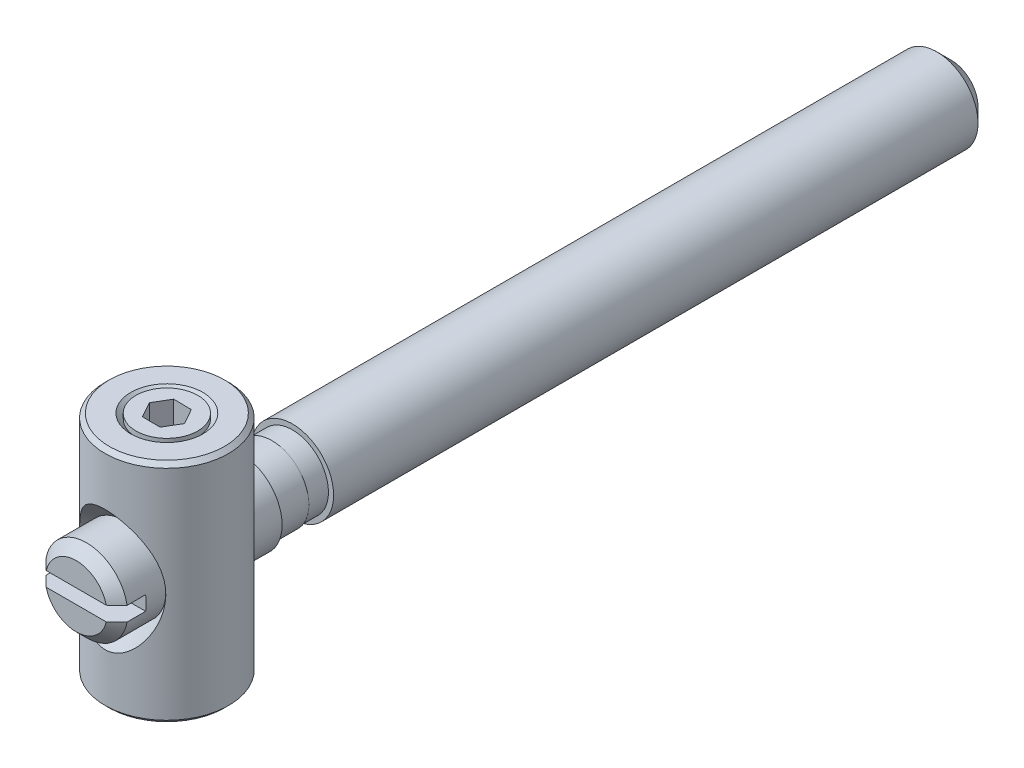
ISO-10303-21;
HEADER;
FILE_DESCRIPTION(('STEP AP214'),'2;1');
FILE_NAME('part.step','',(''),(''),'','','');
FILE_SCHEMA(('AUTOMOTIVE_DESIGN { 1 0 10303 214 1 1 1 1 }'));
ENDSEC;
DATA;
#1=APPLICATION_CONTEXT('core data for automotive mechanical design processes');
#2=APPLICATION_PROTOCOL_DEFINITION('international standard','automotive_design',2000,#1);
#3=PRODUCT_CONTEXT('',#1,'mechanical');
#4=PRODUCT('Part','Part','',(#3));
#5=PRODUCT_RELATED_PRODUCT_CATEGORY('part','',(#4));
#6=PRODUCT_DEFINITION_FORMATION('','',#4);
#7=PRODUCT_DEFINITION_CONTEXT('part definition',#1,'design');
#8=PRODUCT_DEFINITION('design','',#6,#7);
#9=PRODUCT_DEFINITION_SHAPE('','',#8);
#10=(LENGTH_UNIT() NAMED_UNIT(*) SI_UNIT(.MILLI.,.METRE.));
#11=(NAMED_UNIT(*) PLANE_ANGLE_UNIT() SI_UNIT($,.RADIAN.));
#12=(NAMED_UNIT(*) SI_UNIT($,.STERADIAN.) SOLID_ANGLE_UNIT());
#13=UNCERTAINTY_MEASURE_WITH_UNIT(LENGTH_MEASURE(1.E-05),#10,'distance_accuracy_value','');
#14=(GEOMETRIC_REPRESENTATION_CONTEXT(3) GLOBAL_UNCERTAINTY_ASSIGNED_CONTEXT((#13)) GLOBAL_UNIT_ASSIGNED_CONTEXT((#10,
#11,#12)) REPRESENTATION_CONTEXT('',''));
#15=CARTESIAN_POINT('',(0.,0.,0.));
#16=DIRECTION('',(0.,0.,1.));
#17=DIRECTION('',(1.,0.,0.));
#18=AXIS2_PLACEMENT_3D('',#15,#16,#17);
#19=CARTESIAN_POINT('',(0.,0.,34.697365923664));
#20=DIRECTION('',(0.,0.,1.));
#21=DIRECTION('',(1.,0.,0.));
#22=AXIS2_PLACEMENT_3D('',#19,#20,#21);
#23=CYLINDRICAL_SURFACE('',#22,2.);
#24=CARTESIAN_POINT('',(0.,0.,-37.398));
#25=DIRECTION('',(0.,0.,-1.));
#26=DIRECTION('',(0.,-1.,0.));
#27=AXIS2_PLACEMENT_3D('',#24,#25,#26);
#28=CIRCLE('',#27,2.);
#29=CARTESIAN_POINT('',(0.,-2.00000000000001,-37.398));
#30=VERTEX_POINT('',#29);
#31=EDGE_CURVE('E9',#30,#30,#28,.F.);
#32=ORIENTED_EDGE('',*,*,#31,.T.);
#33=EDGE_LOOP('',(#32));
#34=FACE_BOUND('',#33,.T.);
#35=CARTESIAN_POINT('',(0.,0.,-6.098));
#36=DIRECTION('',(0.,0.,1.));
#37=DIRECTION('',(1.,0.,0.));
#38=AXIS2_PLACEMENT_3D('',#35,#36,#37);
#39=CIRCLE('',#38,2.);
#40=CARTESIAN_POINT('',(2.,0.,-6.098));
#41=VERTEX_POINT('',#40);
#42=EDGE_CURVE('E283',#41,#41,#39,.T.);
#43=ORIENTED_EDGE('',*,*,#42,.F.);
#44=EDGE_LOOP('',(#43));
#45=FACE_BOUND('',#44,.T.);
#46=ADVANCED_FACE('F14',(#34,#45),#23,.T.);
#47=CARTESIAN_POINT('',(0.,0.,4.402));
#48=DIRECTION('',(0.,0.,-1.));
#49=DIRECTION('',(-1.,0.,0.));
#50=AXIS2_PLACEMENT_3D('',#47,#48,#49);
#51=PLANE('',#50);
#52=CARTESIAN_POINT('',(0.,0.,4.402));
#53=DIRECTION('',(0.,0.,-1.));
#54=DIRECTION('',(-1.,0.,0.));
#55=AXIS2_PLACEMENT_3D('',#52,#53,#54);
#56=CIRCLE('',#55,1.5);
#57=CARTESIAN_POINT('',(1.45859521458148,0.35,4.402));
#58=VERTEX_POINT('',#57);
#59=CARTESIAN_POINT('',(-1.45859521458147,0.35,4.402));
#60=VERTEX_POINT('',#59);
#61=EDGE_CURVE('E286',#58,#60,#56,.F.);
#62=ORIENTED_EDGE('',*,*,#61,.T.);
#63=DIRECTION('',(-1.,0.,0.));
#64=VECTOR('',#63,1.);
#65=CARTESIAN_POINT('',(-1.96913686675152,0.35,4.402));
#66=LINE('',#65,#64);
#67=EDGE_CURVE('E31',#58,#60,#66,.T.);
#68=ORIENTED_EDGE('',*,*,#67,.F.);
#69=EDGE_LOOP('',(#62,#68));
#70=FACE_BOUND('',#69,.T.);
#71=ADVANCED_FACE('F205',(#70),#51,.F.);
#72=CARTESIAN_POINT('',(-1.45859521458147,-0.35,4.402));
#73=VERTEX_POINT('',#72);
#74=CARTESIAN_POINT('',(1.45859521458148,-0.35,4.402));
#75=VERTEX_POINT('',#74);
#76=EDGE_CURVE('E292',#73,#75,#56,.F.);
#77=ORIENTED_EDGE('',*,*,#76,.T.);
#78=DIRECTION('',(1.,0.,0.));
#79=VECTOR('',#78,1.);
#80=CARTESIAN_POINT('',(-1.96913686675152,-0.35,4.402));
#81=LINE('',#80,#79);
#82=EDGE_CURVE('E324',#73,#75,#81,.T.);
#83=ORIENTED_EDGE('',*,*,#82,.F.);
#84=EDGE_LOOP('',(#77,#83));
#85=FACE_BOUND('',#84,.T.);
#86=ADVANCED_FACE('F212',(#85),#51,.F.);
#87=CARTESIAN_POINT('',(0.,0.,4.402));
#88=DIRECTION('',(0.,0.,-1.));
#89=DIRECTION('',(-1.,0.,0.));
#90=AXIS2_PLACEMENT_3D('',#87,#88,#89);
#91=CONICAL_SURFACE('',#90,1.5,0.785398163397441);
#92=CARTESIAN_POINT('',(4.35126885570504,0.349999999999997,1.53667748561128));
#93=CARTESIAN_POINT('',(4.19641291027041,0.35,1.69103028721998));
#94=CARTESIAN_POINT('',(4.04153476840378,0.350000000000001,1.84536085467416));
#95=CARTESIAN_POINT('',(3.73169612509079,0.350000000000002,2.15395346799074));
#96=CARTESIAN_POINT('',(3.57673562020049,0.350000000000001,2.30821551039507));
#97=CARTESIAN_POINT('',(3.2665365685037,0.350000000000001,2.616803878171));
#98=CARTESIAN_POINT('',(3.11129790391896,0.350000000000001,2.77113008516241));
#99=CARTESIAN_POINT('',(2.8006638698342,0.350000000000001,3.07961097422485));
#100=CARTESIAN_POINT('',(2.64526850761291,0.350000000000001,3.23376566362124));
#101=CARTESIAN_POINT('',(2.34228144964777,0.350000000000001,3.5338017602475));
#102=CARTESIAN_POINT('',(2.19470355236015,0.350000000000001,3.67969710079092));
#103=CARTESIAN_POINT('',(1.89910586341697,0.350000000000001,3.97107818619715));
#104=CARTESIAN_POINT('',(1.7510860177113,0.350000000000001,4.11656387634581));
#105=CARTESIAN_POINT('',(1.52844687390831,0.350000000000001,4.33406929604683));
#106=CARTESIAN_POINT('',(1.45415744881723,0.350000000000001,4.40642627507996));
#107=CARTESIAN_POINT('',(1.30522725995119,0.350000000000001,4.55078536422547));
#108=CARTESIAN_POINT('',(1.23058647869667,0.350000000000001,4.62278745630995));
#109=CARTESIAN_POINT('',(1.08076094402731,0.350000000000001,4.76619144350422));
#110=CARTESIAN_POINT('',(1.00557632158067,0.350000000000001,4.83759347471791));
#111=CARTESIAN_POINT('',(0.892022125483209,0.350000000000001,4.94386077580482));
#112=CARTESIAN_POINT('',(0.85404275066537,0.350000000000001,4.97914249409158));
#113=CARTESIAN_POINT('',(0.777709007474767,0.350000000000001,5.04929736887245));
#114=CARTESIAN_POINT('',(0.73935465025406,0.35,5.08417053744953));
#115=CARTESIAN_POINT('',(0.679196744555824,0.35,5.13798633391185));
#116=CARTESIAN_POINT('',(0.657585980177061,0.350000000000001,5.15714426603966));
#117=CARTESIAN_POINT('',(0.614138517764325,0.350000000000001,5.19520729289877));
#118=CARTESIAN_POINT('',(0.592301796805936,0.350000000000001,5.21411236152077));
#119=CARTESIAN_POINT('',(0.548146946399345,0.350000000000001,5.25174589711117));
#120=CARTESIAN_POINT('',(0.525826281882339,0.350000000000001,5.27047139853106));
#121=CARTESIAN_POINT('',(0.480797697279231,0.350000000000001,5.3074405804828));
#122=CARTESIAN_POINT('',(0.458089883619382,0.35,5.3256843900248));
#123=CARTESIAN_POINT('',(0.411906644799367,0.35,5.36167156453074));
#124=CARTESIAN_POINT('',(0.388425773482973,0.350000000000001,5.37940798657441));
#125=CARTESIAN_POINT('',(0.340709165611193,0.350000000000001,5.41383103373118));
#126=CARTESIAN_POINT('',(0.316473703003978,0.350000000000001,5.43051803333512));
#127=CARTESIAN_POINT('',(0.267118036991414,0.350000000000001,5.46212071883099));
#128=CARTESIAN_POINT('',(0.242006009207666,0.350000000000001,5.47704896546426));
#129=CARTESIAN_POINT('',(0.190376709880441,0.350000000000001,5.50417839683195));
#130=CARTESIAN_POINT('',(0.16386395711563,0.35,5.51638775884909));
#131=CARTESIAN_POINT('',(0.115662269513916,0.35,5.53389096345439));
#132=CARTESIAN_POINT('',(0.0943343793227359,0.350000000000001,5.54014013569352));
#133=CARTESIAN_POINT('',(0.050967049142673,0.350000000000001,5.54893856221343));
#134=CARTESIAN_POINT('',(0.0289307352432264,0.35,5.55150226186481));
#135=CARTESIAN_POINT('',(-0.0153473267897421,0.35,5.55236596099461));
#136=CARTESIAN_POINT('',(-0.0375895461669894,0.350000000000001,5.55064352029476));
#137=CARTESIAN_POINT('',(-0.0814521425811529,0.350000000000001,5.54330655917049));
#138=CARTESIAN_POINT('',(-0.10307022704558,0.35,5.53767922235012));
#139=CARTESIAN_POINT('',(-0.146000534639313,0.35,5.52332975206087));
#140=CARTESIAN_POINT('',(-0.167279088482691,0.350000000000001,5.51451156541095));
#141=CARTESIAN_POINT('',(-0.208879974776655,0.350000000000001,5.49482143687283));
#142=CARTESIAN_POINT('',(-0.229200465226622,0.350000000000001,5.48394572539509));
#143=CARTESIAN_POINT('',(-0.269207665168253,0.350000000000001,5.46074603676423));
#144=CARTESIAN_POINT('',(-0.288887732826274,0.350000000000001,5.44841081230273));
#145=CARTESIAN_POINT('',(-0.327605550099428,0.350000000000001,5.42281699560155));
#146=CARTESIAN_POINT('',(-0.346643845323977,0.35,5.40955921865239));
#147=CARTESIAN_POINT('',(-0.40644569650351,0.35,5.36638652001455));
#148=CARTESIAN_POINT('',(-0.446338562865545,0.35,5.33527476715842));
#149=CARTESIAN_POINT('',(-0.524892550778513,0.350000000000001,5.27152437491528));
#150=CARTESIAN_POINT('',(-0.563552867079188,0.350000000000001,5.23888477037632));
#151=CARTESIAN_POINT('',(-0.640169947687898,0.35,5.17265387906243));
#152=CARTESIAN_POINT('',(-0.678125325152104,0.350000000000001,5.1390609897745));
#153=CARTESIAN_POINT('',(-0.753518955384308,0.350000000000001,5.07132508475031));
#154=CARTESIAN_POINT('',(-0.790957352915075,0.350000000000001,5.03718222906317));
#155=CARTESIAN_POINT('',(-0.902510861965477,0.35,4.93443874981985));
#156=CARTESIAN_POINT('',(-0.976123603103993,0.350000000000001,4.86529362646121));
#157=CARTESIAN_POINT('',(-1.12257494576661,0.35,4.72634664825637));
#158=CARTESIAN_POINT('',(-1.19541427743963,0.35,4.65654555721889));
#159=CARTESIAN_POINT('',(-1.39829359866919,0.35,4.46099580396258));
#160=CARTESIAN_POINT('',(-1.52788326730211,0.35,4.33478022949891));
#161=CARTESIAN_POINT('',(-1.78647544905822,0.35,4.08174671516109));
#162=CARTESIAN_POINT('',(-1.91547795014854,0.35,3.95492876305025));
#163=CARTESIAN_POINT('',(-2.17321511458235,0.35,3.70088959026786));
#164=CARTESIAN_POINT('',(-2.30194960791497,0.35,3.57366819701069));
#165=CARTESIAN_POINT('',(-2.55921717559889,0.35,3.31902418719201));
#166=CARTESIAN_POINT('',(-2.68775025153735,0.35,3.19160157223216));
#167=CARTESIAN_POINT('',(-3.07247665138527,0.35,2.80981746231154));
#168=CARTESIAN_POINT('',(-3.32848011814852,0.349999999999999,2.55526465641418));
#169=CARTESIAN_POINT('',(-3.71223239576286,0.35,2.17332351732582));
#170=CARTESIAN_POINT('',(-3.84007220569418,0.35,2.04602651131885));
#171=CARTESIAN_POINT('',(-4.09570351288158,0.349999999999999,1.79138474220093));
#172=CARTESIAN_POINT('',(-4.22349501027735,0.349999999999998,1.66403997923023));
#173=CARTESIAN_POINT('',(-4.35126885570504,0.349999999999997,1.53667748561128));
#174=B_SPLINE_CURVE_WITH_KNOTS('',3,(#92,#93,#94,#95,#96,#97,#98,#99,#100,#101,#102,#103,#104,
#105,#106,#107,#108,#109,#110,#111,#112,#113,#114,#115,#116,#117,#118,#119,#120,#121,#122,#123,
#124,#125,#126,#127,#128,#129,#130,#131,#132,#133,#134,#135,#136,#137,#138,#139,#140,#141,#142,
#143,#144,#145,#146,#147,#148,#149,#150,#151,#152,#153,#154,#155,#156,#157,#158,#159,#160,#161,
#162,#163,#164,#165,#166,#167,#168,#169,#170,#171,#172,#173),.UNSPECIFIED.,.F.,.F.,(4,2,2,2,2,2,
2,2,2,2,2,2,2,2,2,2,2,2,2,2,2,2,2,2,2,2,2,2,2,2,2,2,2,2,2,2,2,2,2,2,4),(0.,0.655931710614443,
1.31189343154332,1.96858248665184,2.62524232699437,3.24780305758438,3.87044333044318,
4.18155345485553,4.49267922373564,4.80373240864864,4.95924629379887,5.1147555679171,
5.20139397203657,5.28804125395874,5.37544205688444,5.46281920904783,5.55108162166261,
5.63931235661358,5.72686889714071,5.81415843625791,5.88059131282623,5.94676308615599,
6.0132820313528,6.08002033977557,6.14896231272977,6.21803183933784,6.28767333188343,
6.3572540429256,6.50893272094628,6.66070854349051,6.812756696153,6.9647613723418,
7.26773191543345,7.57038509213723,8.11307078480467,8.65576754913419,9.19874089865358,
9.74170994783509,10.8247672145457,11.3659953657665,11.9072219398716),.UNSPECIFIED.);
#175=CARTESIAN_POINT('',(1.96913686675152,0.35,3.902));
#176=VERTEX_POINT('',#175);
#177=EDGE_CURVE('E242',#176,#58,#174,.T.);
#178=ORIENTED_EDGE('',*,*,#177,.F.);
#179=CARTESIAN_POINT('',(0.,0.,3.902));
#180=DIRECTION('',(0.,0.,-1.));
#181=DIRECTION('',(-1.,0.,0.));
#182=AXIS2_PLACEMENT_3D('',#179,#180,#181);
#183=CIRCLE('',#182,2.);
#184=CARTESIAN_POINT('',(-1.96913686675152,0.35,3.902));
#185=VERTEX_POINT('',#184);
#186=EDGE_CURVE('E295',#185,#176,#183,.T.);
#187=ORIENTED_EDGE('',*,*,#186,.F.);
#188=EDGE_CURVE('E229',#60,#185,#174,.T.);
#189=ORIENTED_EDGE('',*,*,#188,.F.);
#190=ORIENTED_EDGE('',*,*,#61,.F.);
#191=EDGE_LOOP('',(#178,#187,#189,#190));
#192=FACE_BOUND('',#191,.T.);
#193=ADVANCED_FACE('F220',(#192),#91,.T.);
#194=CARTESIAN_POINT('',(-1.96913686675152,0.35,3.002));
#195=DIRECTION('',(0.,1.,0.));
#196=DIRECTION('',(-1.,0.,0.));
#197=AXIS2_PLACEMENT_3D('',#194,#195,#196);
#198=PLANE('',#197);
#199=ORIENTED_EDGE('',*,*,#177,.T.);
#200=ORIENTED_EDGE('',*,*,#67,.T.);
#201=ORIENTED_EDGE('',*,*,#188,.T.);
#202=DIRECTION('',(0.,0.,1.));
#203=VECTOR('',#202,1.);
#204=CARTESIAN_POINT('',(-1.96913686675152,0.35,3.002));
#205=LINE('',#204,#203);
#206=CARTESIAN_POINT('',(-1.96913686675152,0.35,3.002));
#207=VERTEX_POINT('',#206);
#208=EDGE_CURVE('E341',#207,#185,#205,.T.);
#209=ORIENTED_EDGE('',*,*,#208,.F.);
#210=DIRECTION('',(-1.,0.,0.));
#211=VECTOR('',#210,1.);
#212=CARTESIAN_POINT('',(-1.96913686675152,0.35,3.002));
#213=LINE('',#212,#211);
#214=CARTESIAN_POINT('',(1.96913686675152,0.35,3.002));
#215=VERTEX_POINT('',#214);
#216=EDGE_CURVE('E332',#215,#207,#213,.T.);
#217=ORIENTED_EDGE('',*,*,#216,.F.);
#218=DIRECTION('',(0.,0.,1.));
#219=VECTOR('',#218,1.);
#220=CARTESIAN_POINT('',(1.96913686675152,0.35,3.002));
#221=LINE('',#220,#219);
#222=EDGE_CURVE('E343',#215,#176,#221,.T.);
#223=ORIENTED_EDGE('',*,*,#222,.T.);
#224=EDGE_LOOP('',(#199,#200,#201,#209,#217,#223));
#225=FACE_BOUND('',#224,.T.);
#226=ADVANCED_FACE('F224',(#225),#198,.F.);
#227=CARTESIAN_POINT('',(0.,0.,3.002));
#228=DIRECTION('',(0.,0.,1.));
#229=DIRECTION('',(1.,0.,0.));
#230=AXIS2_PLACEMENT_3D('',#227,#228,#229);
#231=PLANE('',#230);
#232=CARTESIAN_POINT('',(0.,0.,3.002));
#233=DIRECTION('',(0.,0.,1.));
#234=DIRECTION('',(1.,0.,0.));
#235=AXIS2_PLACEMENT_3D('',#232,#233,#234);
#236=CIRCLE('',#235,2.);
#237=CARTESIAN_POINT('',(1.96913686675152,-0.35,3.002));
#238=VERTEX_POINT('',#237);
#239=EDGE_CURVE('E329',#238,#215,#236,.T.);
#240=ORIENTED_EDGE('',*,*,#239,.T.);
#241=ORIENTED_EDGE('',*,*,#216,.T.);
#242=CARTESIAN_POINT('',(0.,0.,3.002));
#243=DIRECTION('',(0.,0.,1.));
#244=DIRECTION('',(1.,0.,0.));
#245=AXIS2_PLACEMENT_3D('',#242,#243,#244);
#246=CIRCLE('',#245,2.);
#247=CARTESIAN_POINT('',(-1.96913686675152,-0.35,3.002));
#248=VERTEX_POINT('',#247);
#249=EDGE_CURVE('E362',#207,#248,#246,.T.);
#250=ORIENTED_EDGE('',*,*,#249,.T.);
#251=DIRECTION('',(1.,0.,0.));
#252=VECTOR('',#251,1.);
#253=CARTESIAN_POINT('',(-1.96913686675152,-0.35,3.002));
#254=LINE('',#253,#252);
#255=EDGE_CURVE('E346',#248,#238,#254,.T.);
#256=ORIENTED_EDGE('',*,*,#255,.T.);
#257=EDGE_LOOP('',(#240,#241,#250,#256));
#258=FACE_BOUND('',#257,.T.);
#259=ADVANCED_FACE('F247',(#258),#231,.T.);
#260=CARTESIAN_POINT('',(-1.96913686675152,-0.35,3.002));
#261=DIRECTION('',(0.,-1.,0.));
#262=DIRECTION('',(1.,0.,0.));
#263=AXIS2_PLACEMENT_3D('',#260,#261,#262);
#264=PLANE('',#263);
#265=CARTESIAN_POINT('',(-4.35126885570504,-0.35,1.53667748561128));
#266=CARTESIAN_POINT('',(-4.19641291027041,-0.35,1.69103028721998));
#267=CARTESIAN_POINT('',(-4.04153476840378,-0.35,1.84536085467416));
#268=CARTESIAN_POINT('',(-3.73169612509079,-0.35,2.15395346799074));
#269=CARTESIAN_POINT('',(-3.57673562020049,-0.35,2.30821551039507));
#270=CARTESIAN_POINT('',(-3.2665365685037,-0.35,2.616803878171));
#271=CARTESIAN_POINT('',(-3.11129790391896,-0.35,2.77113008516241));
#272=CARTESIAN_POINT('',(-2.80066386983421,-0.35,3.07961097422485));
#273=CARTESIAN_POINT('',(-2.64526850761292,-0.35,3.23376566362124));
#274=CARTESIAN_POINT('',(-2.34228144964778,-0.35,3.53380176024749));
#275=CARTESIAN_POINT('',(-2.19470355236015,-0.35,3.67969710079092));
#276=CARTESIAN_POINT('',(-1.89910586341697,-0.35,3.97107818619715));
#277=CARTESIAN_POINT('',(-1.75108601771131,-0.35,4.11656387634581));
#278=CARTESIAN_POINT('',(-1.52844687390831,-0.35,4.33406929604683));
#279=CARTESIAN_POINT('',(-1.45415744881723,-0.35,4.40642627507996));
#280=CARTESIAN_POINT('',(-1.30522725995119,-0.35,4.55078536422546));
#281=CARTESIAN_POINT('',(-1.23058647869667,-0.35,4.62278745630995));
#282=CARTESIAN_POINT('',(-1.08076094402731,-0.35,4.76619144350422));
#283=CARTESIAN_POINT('',(-1.00557632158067,-0.35,4.83759347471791));
#284=CARTESIAN_POINT('',(-0.89202212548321,-0.35,4.94386077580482));
#285=CARTESIAN_POINT('',(-0.854042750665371,-0.35,4.97914249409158));
#286=CARTESIAN_POINT('',(-0.777709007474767,-0.35,5.04929736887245));
#287=CARTESIAN_POINT('',(-0.739354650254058,-0.35,5.08417053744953));
#288=CARTESIAN_POINT('',(-0.679196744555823,-0.35,5.13798633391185));
#289=CARTESIAN_POINT('',(-0.65758598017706,-0.35,5.15714426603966));
#290=CARTESIAN_POINT('',(-0.614138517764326,-0.35,5.19520729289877));
#291=CARTESIAN_POINT('',(-0.592301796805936,-0.35,5.21411236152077));
#292=CARTESIAN_POINT('',(-0.548146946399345,-0.35,5.25174589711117));
#293=CARTESIAN_POINT('',(-0.52582628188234,-0.35,5.27047139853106));
#294=CARTESIAN_POINT('',(-0.480797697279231,-0.35,5.30744058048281));
#295=CARTESIAN_POINT('',(-0.458089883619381,-0.35,5.3256843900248));
#296=CARTESIAN_POINT('',(-0.411906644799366,-0.35,5.36167156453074));
#297=CARTESIAN_POINT('',(-0.388425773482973,-0.35,5.37940798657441));
#298=CARTESIAN_POINT('',(-0.340709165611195,-0.35,5.41383103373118));
#299=CARTESIAN_POINT('',(-0.316473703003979,-0.35,5.43051803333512));
#300=CARTESIAN_POINT('',(-0.267118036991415,-0.35,5.46212071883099));
#301=CARTESIAN_POINT('',(-0.242006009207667,-0.35,5.47704896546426));
#302=CARTESIAN_POINT('',(-0.190376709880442,-0.35,5.50417839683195));
#303=CARTESIAN_POINT('',(-0.163863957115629,-0.35,5.51638775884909));
#304=CARTESIAN_POINT('',(-0.115662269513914,-0.35,5.53389096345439));
#305=CARTESIAN_POINT('',(-0.0943343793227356,-0.35,5.54014013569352));
#306=CARTESIAN_POINT('',(-0.050967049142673,-0.35,5.54893856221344));
#307=CARTESIAN_POINT('',(-0.0289307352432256,-0.35,5.55150226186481));
#308=CARTESIAN_POINT('',(0.0153473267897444,-0.35,5.55236596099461));
#309=CARTESIAN_POINT('',(0.0375895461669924,-0.35,5.55064352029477));
#310=CARTESIAN_POINT('',(0.0814521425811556,-0.35,5.5433065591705));
#311=CARTESIAN_POINT('',(0.103070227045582,-0.35,5.53767922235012));
#312=CARTESIAN_POINT('',(0.146000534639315,-0.35,5.52332975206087));
#313=CARTESIAN_POINT('',(0.167279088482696,-0.35,5.51451156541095));
#314=CARTESIAN_POINT('',(0.208879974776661,-0.35,5.49482143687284));
#315=CARTESIAN_POINT('',(0.229200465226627,-0.35,5.4839457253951));
#316=CARTESIAN_POINT('',(0.269207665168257,-0.35,5.46074603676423));
#317=CARTESIAN_POINT('',(0.288887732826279,-0.35,5.44841081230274));
#318=CARTESIAN_POINT('',(0.327605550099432,-0.35,5.42281699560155));
#319=CARTESIAN_POINT('',(0.34664384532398,-0.35,5.40955921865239));
#320=CARTESIAN_POINT('',(0.406445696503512,-0.35,5.36638652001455));
#321=CARTESIAN_POINT('',(0.446338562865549,-0.35,5.33527476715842));
#322=CARTESIAN_POINT('',(0.524892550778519,-0.35,5.27152437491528));
#323=CARTESIAN_POINT('',(0.563552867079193,-0.35,5.23888477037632));
#324=CARTESIAN_POINT('',(0.640169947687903,-0.35,5.17265387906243));
#325=CARTESIAN_POINT('',(0.678125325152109,-0.35,5.1390609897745));
#326=CARTESIAN_POINT('',(0.753518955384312,-0.35,5.07132508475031));
#327=CARTESIAN_POINT('',(0.790957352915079,-0.35,5.03718222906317));
#328=CARTESIAN_POINT('',(0.902510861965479,-0.35,4.93443874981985));
#329=CARTESIAN_POINT('',(0.976123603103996,-0.35,4.86529362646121));
#330=CARTESIAN_POINT('',(1.12257494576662,-0.35,4.72634664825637));
#331=CARTESIAN_POINT('',(1.19541427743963,-0.35,4.65654555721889));
#332=CARTESIAN_POINT('',(1.39829359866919,-0.35,4.46099580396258));
#333=CARTESIAN_POINT('',(1.52788326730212,-0.35,4.33478022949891));
#334=CARTESIAN_POINT('',(1.78647544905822,-0.35,4.08174671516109));
#335=CARTESIAN_POINT('',(1.91547795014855,-0.35,3.95492876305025));
#336=CARTESIAN_POINT('',(2.17321511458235,-0.35,3.70088959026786));
#337=CARTESIAN_POINT('',(2.30194960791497,-0.35,3.57366819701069));
#338=CARTESIAN_POINT('',(2.55921717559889,-0.35,3.31902418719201));
#339=CARTESIAN_POINT('',(2.68775025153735,-0.35,3.19160157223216));
#340=CARTESIAN_POINT('',(3.07247665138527,-0.35,2.80981746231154));
#341=CARTESIAN_POINT('',(3.32848011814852,-0.35,2.55526465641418));
#342=CARTESIAN_POINT('',(3.71223239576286,-0.35,2.17332351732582));
#343=CARTESIAN_POINT('',(3.84007220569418,-0.35,2.04602651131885));
#344=CARTESIAN_POINT('',(4.09570351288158,-0.35,1.79138474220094));
#345=CARTESIAN_POINT('',(4.22349501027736,-0.35,1.66403997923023));
#346=CARTESIAN_POINT('',(4.35126885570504,-0.35,1.53667748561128));
#347=B_SPLINE_CURVE_WITH_KNOTS('',3,(#265,#266,#267,#268,#269,#270,#271,#272,#273,#274,#275,
#276,#277,#278,#279,#280,#281,#282,#283,#284,#285,#286,#287,#288,#289,#290,#291,#292,#293,#294,
#295,#296,#297,#298,#299,#300,#301,#302,#303,#304,#305,#306,#307,#308,#309,#310,#311,#312,#313,
#314,#315,#316,#317,#318,#319,#320,#321,#322,#323,#324,#325,#326,#327,#328,#329,#330,#331,#332,
#333,#334,#335,#336,#337,#338,#339,#340,#341,#342,#343,#344,#345,#346),.UNSPECIFIED.,.F.,.F.,(4,
2,2,2,2,2,2,2,2,2,2,2,2,2,2,2,2,2,2,2,2,2,2,2,2,2,2,2,2,2,2,2,2,2,2,2,2,2,2,2,4),(0.,
0.655931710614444,1.31189343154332,1.96858248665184,2.62524232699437,3.24780305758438,
3.87044333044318,4.18155345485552,4.49267922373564,4.80373240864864,4.95924629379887,
5.1147555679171,5.20139397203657,5.28804125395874,5.37544205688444,5.46281920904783,
5.55108162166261,5.63931235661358,5.72686889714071,5.81415843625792,5.88059131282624,
5.946763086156,6.0132820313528,6.08002033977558,6.14896231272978,6.21803183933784,
6.28767333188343,6.35725404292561,6.50893272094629,6.66070854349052,6.812756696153,
6.96476137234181,7.26773191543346,7.57038509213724,8.11307078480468,8.65576754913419,
9.19874089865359,9.7417099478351,10.8247672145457,11.3659953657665,11.9072219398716),.UNSPECIFIED.);
#348=CARTESIAN_POINT('',(-1.96913686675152,-0.35,3.902));
#349=VERTEX_POINT('',#348);
#350=EDGE_CURVE('E134',#349,#73,#347,.T.);
#351=ORIENTED_EDGE('',*,*,#350,.T.);
#352=ORIENTED_EDGE('',*,*,#82,.T.);
#353=CARTESIAN_POINT('',(1.96913686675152,-0.35,3.902));
#354=VERTEX_POINT('',#353);
#355=EDGE_CURVE('E236',#75,#354,#347,.T.);
#356=ORIENTED_EDGE('',*,*,#355,.T.);
#357=DIRECTION('',(0.,0.,1.));
#358=VECTOR('',#357,1.);
#359=CARTESIAN_POINT('',(1.96913686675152,-0.35,3.002));
#360=LINE('',#359,#358);
#361=EDGE_CURVE('E313',#238,#354,#360,.T.);
#362=ORIENTED_EDGE('',*,*,#361,.F.);
#363=ORIENTED_EDGE('',*,*,#255,.F.);
#364=DIRECTION('',(0.,0.,1.));
#365=VECTOR('',#364,1.);
#366=CARTESIAN_POINT('',(-1.96913686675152,-0.35,3.002));
#367=LINE('',#366,#365);
#368=EDGE_CURVE('E310',#248,#349,#367,.T.);
#369=ORIENTED_EDGE('',*,*,#368,.T.);
#370=EDGE_LOOP('',(#351,#352,#356,#362,#363,#369));
#371=FACE_BOUND('',#370,.T.);
#372=ADVANCED_FACE('F243',(#371),#264,.F.);
#373=ORIENTED_EDGE('',*,*,#350,.F.);
#374=EDGE_CURVE('E294',#354,#349,#183,.T.);
#375=ORIENTED_EDGE('',*,*,#374,.F.);
#376=ORIENTED_EDGE('',*,*,#355,.F.);
#377=ORIENTED_EDGE('',*,*,#76,.F.);
#378=EDGE_LOOP('',(#373,#375,#376,#377));
#379=FACE_BOUND('',#378,.T.);
#380=ADVANCED_FACE('F226',(#379),#91,.T.);
#381=CARTESIAN_POINT('',(0.,0.,34.697365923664));
#382=DIRECTION('',(0.,0.,1.));
#383=DIRECTION('',(1.,0.,0.));
#384=AXIS2_PLACEMENT_3D('',#381,#382,#383);
#385=CYLINDRICAL_SURFACE('',#384,2.);
#386=ORIENTED_EDGE('',*,*,#374,.T.);
#387=ORIENTED_EDGE('',*,*,#368,.F.);
#388=ORIENTED_EDGE('',*,*,#249,.F.);
#389=ORIENTED_EDGE('',*,*,#208,.T.);
#390=ORIENTED_EDGE('',*,*,#186,.T.);
#391=ORIENTED_EDGE('',*,*,#222,.F.);
#392=ORIENTED_EDGE('',*,*,#239,.F.);
#393=ORIENTED_EDGE('',*,*,#361,.T.);
#394=EDGE_LOOP('',(#386,#387,#388,#389,#390,#391,#392,#393));
#395=FACE_BOUND('',#394,.T.);
#396=CARTESIAN_POINT('',(0.,0.,2.05));
#397=DIRECTION('',(0.,0.,1.));
#398=DIRECTION('',(1.,0.,0.));
#399=AXIS2_PLACEMENT_3D('',#396,#397,#398);
#400=CIRCLE('',#399,2.);
#401=CARTESIAN_POINT('',(2.,0.,2.05));
#402=VERTEX_POINT('',#401);
#403=EDGE_CURVE('E129',#402,#402,#400,.F.);
#404=ORIENTED_EDGE('',*,*,#403,.F.);
#405=EDGE_LOOP('',(#404));
#406=FACE_BOUND('',#405,.T.);
#407=ADVANCED_FACE('F256',(#395,#406),#385,.T.);
#408=CARTESIAN_POINT('',(0.,0.,-3.598));
#409=DIRECTION('',(0.,0.,1.));
#410=DIRECTION('',(1.,0.,0.));
#411=AXIS2_PLACEMENT_3D('',#408,#409,#410);
#412=CIRCLE('',#411,2.);
#413=CARTESIAN_POINT('',(2.,0.,-3.598));
#414=VERTEX_POINT('',#413);
#415=EDGE_CURVE('E339',#414,#414,#412,.T.);
#416=ORIENTED_EDGE('',*,*,#415,.T.);
#417=EDGE_LOOP('',(#416));
#418=FACE_BOUND('',#417,.T.);
#419=CARTESIAN_POINT('',(0.,0.,-2.05));
#420=DIRECTION('',(0.,0.,-1.));
#421=DIRECTION('',(-1.,0.,0.));
#422=AXIS2_PLACEMENT_3D('',#419,#420,#421);
#423=CIRCLE('',#422,2.);
#424=CARTESIAN_POINT('',(-2.,0.,-2.05));
#425=VERTEX_POINT('',#424);
#426=EDGE_CURVE('E125',#425,#425,#423,.F.);
#427=ORIENTED_EDGE('',*,*,#426,.F.);
#428=EDGE_LOOP('',(#427));
#429=FACE_BOUND('',#428,.T.);
#430=ADVANCED_FACE('F253',(#418,#429),#385,.T.);
#431=CARTESIAN_POINT('',(0.,1.75,-6.098));
#432=DIRECTION('',(0.,0.,-1.));
#433=DIRECTION('',(-1.,0.,0.));
#434=AXIS2_PLACEMENT_3D('',#431,#432,#433);
#435=PLANE('',#434);
#436=CARTESIAN_POINT('',(0.,0.,-6.098));
#437=DIRECTION('',(0.,0.,1.));
#438=DIRECTION('',(1.,0.,0.));
#439=AXIS2_PLACEMENT_3D('',#436,#437,#438);
#440=CIRCLE('',#439,1.75);
#441=CARTESIAN_POINT('',(1.75,0.,-6.098));
#442=VERTEX_POINT('',#441);
#443=EDGE_CURVE('E282',#442,#442,#440,.T.);
#444=ORIENTED_EDGE('',*,*,#443,.F.);
#445=EDGE_LOOP('',(#444));
#446=FACE_BOUND('',#445,.T.);
#447=ORIENTED_EDGE('',*,*,#42,.T.);
#448=EDGE_LOOP('',(#447));
#449=FACE_BOUND('',#448,.T.);
#450=ADVANCED_FACE('F218',(#446,#449),#435,.F.);
#451=CARTESIAN_POINT('',(0.,0.,34.697365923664));
#452=DIRECTION('',(0.,0.,1.));
#453=DIRECTION('',(1.,0.,0.));
#454=AXIS2_PLACEMENT_3D('',#451,#452,#453);
#455=CYLINDRICAL_SURFACE('',#454,1.75);
#456=CARTESIAN_POINT('',(0.,0.,-5.098));
#457=DIRECTION('',(0.,0.,1.));
#458=DIRECTION('',(1.,0.,0.));
#459=AXIS2_PLACEMENT_3D('',#456,#457,#458);
#460=CIRCLE('',#459,1.75);
#461=CARTESIAN_POINT('',(1.75,0.,-5.098));
#462=VERTEX_POINT('',#461);
#463=EDGE_CURVE('E279',#462,#462,#460,.T.);
#464=ORIENTED_EDGE('',*,*,#463,.F.);
#465=EDGE_LOOP('',(#464));
#466=FACE_BOUND('',#465,.T.);
#467=ORIENTED_EDGE('',*,*,#443,.T.);
#468=EDGE_LOOP('',(#467));
#469=FACE_BOUND('',#468,.T.);
#470=ADVANCED_FACE('F267',(#466,#469),#455,.T.);
#471=CARTESIAN_POINT('',(0.,1.75,-5.098));
#472=DIRECTION('',(0.,0.,1.));
#473=DIRECTION('',(1.,0.,0.));
#474=AXIS2_PLACEMENT_3D('',#471,#472,#473);
#475=PLANE('',#474);
#476=CARTESIAN_POINT('',(0.,0.,-5.098));
#477=DIRECTION('',(0.,0.,1.));
#478=DIRECTION('',(1.,0.,0.));
#479=AXIS2_PLACEMENT_3D('',#476,#477,#478);
#480=CIRCLE('',#479,1.8);
#481=CARTESIAN_POINT('',(1.8,0.,-5.098));
#482=VERTEX_POINT('',#481);
#483=EDGE_CURVE('E288',#482,#482,#480,.T.);
#484=ORIENTED_EDGE('',*,*,#483,.F.);
#485=EDGE_LOOP('',(#484));
#486=FACE_BOUND('',#485,.T.);
#487=ORIENTED_EDGE('',*,*,#463,.T.);
#488=EDGE_LOOP('',(#487));
#489=FACE_BOUND('',#488,.T.);
#490=ADVANCED_FACE('F264',(#486,#489),#475,.F.);
#491=CARTESIAN_POINT('',(0.,0.,34.697365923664));
#492=DIRECTION('',(0.,0.,1.));
#493=DIRECTION('',(1.,0.,0.));
#494=AXIS2_PLACEMENT_3D('',#491,#492,#493);
#495=CYLINDRICAL_SURFACE('',#494,1.8);
#496=CARTESIAN_POINT('',(0.,0.,-3.598));
#497=DIRECTION('',(0.,0.,1.));
#498=DIRECTION('',(1.,0.,0.));
#499=AXIS2_PLACEMENT_3D('',#496,#497,#498);
#500=CIRCLE('',#499,1.8);
#501=CARTESIAN_POINT('',(1.8,0.,-3.598));
#502=VERTEX_POINT('',#501);
#503=EDGE_CURVE('E349',#502,#502,#500,.T.);
#504=ORIENTED_EDGE('',*,*,#503,.F.);
#505=EDGE_LOOP('',(#504));
#506=FACE_BOUND('',#505,.T.);
#507=ORIENTED_EDGE('',*,*,#483,.T.);
#508=EDGE_LOOP('',(#507));
#509=FACE_BOUND('',#508,.T.);
#510=ADVANCED_FACE('F260',(#506,#509),#495,.T.);
#511=CARTESIAN_POINT('',(0.,1.8,-3.598));
#512=DIRECTION('',(0.,0.,1.));
#513=DIRECTION('',(1.,0.,0.));
#514=AXIS2_PLACEMENT_3D('',#511,#512,#513);
#515=PLANE('',#514);
#516=ORIENTED_EDGE('',*,*,#415,.F.);
#517=EDGE_LOOP('',(#516));
#518=FACE_BOUND('',#517,.T.);
#519=ORIENTED_EDGE('',*,*,#503,.T.);
#520=EDGE_LOOP('',(#519));
#521=FACE_BOUND('',#520,.T.);
#522=ADVANCED_FACE('F177',(#518,#521),#515,.F.);
#523=CARTESIAN_POINT('',(0.,0.,-3.));
#524=DIRECTION('',(0.,0.,-1.));
#525=DIRECTION('',(0.,-1.,0.));
#526=AXIS2_PLACEMENT_3D('',#523,#524,#525);
#527=CONICAL_SURFACE('',#526,2.95,0.785398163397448);
#528=CARTESIAN_POINT('',(1.55574486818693,1.97618484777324,-2.56508516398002));
#529=CARTESIAN_POINT('',(1.49200000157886,2.07557437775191,-2.60374741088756));
#530=CARTESIAN_POINT('',(1.42218409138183,2.1709053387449,-2.64286056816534));
#531=CARTESIAN_POINT('',(1.26934325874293,2.3511378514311,-2.71957176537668));
#532=CARTESIAN_POINT('',(1.18632803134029,2.43604697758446,-2.75717089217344));
#533=CARTESIAN_POINT('',(1.02594664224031,2.57467109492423,-2.82013065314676));
#534=CARTESIAN_POINT('',(0.951327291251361,2.63114479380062,-2.84636788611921));
#535=CARTESIAN_POINT('',(0.793469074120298,2.73292367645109,-2.89433640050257));
#536=CARTESIAN_POINT('',(0.710241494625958,2.7782432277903,-2.91607347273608));
#537=CARTESIAN_POINT('',(0.550647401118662,2.84826344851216,-2.94996282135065));
#538=CARTESIAN_POINT('',(0.475459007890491,2.87514428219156,-2.96310984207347));
#539=CARTESIAN_POINT('',(0.321126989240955,2.91722348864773,-2.98377596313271));
#540=CARTESIAN_POINT('',(0.241986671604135,2.93243146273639,-2.99129968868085));
#541=CARTESIAN_POINT('',(0.0815590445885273,2.94994751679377,-2.99997048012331));
#542=CARTESIAN_POINT('',(0.000263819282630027,2.9521985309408,-3.00108933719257));
#543=CARTESIAN_POINT('',(-0.161429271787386,2.943434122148,-2.99674574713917));
#544=CARTESIAN_POINT('',(-0.24182697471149,2.93241633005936,-2.99128212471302));
#545=CARTESIAN_POINT('',(-0.394039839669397,2.89923486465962,-2.97493095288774));
#546=CARTESIAN_POINT('',(-0.466071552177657,2.87785284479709,-2.96442422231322));
#547=CARTESIAN_POINT('',(-0.605828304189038,2.82577461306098,-2.93905193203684));
#548=CARTESIAN_POINT('',(-0.673551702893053,2.79507487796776,-2.9241847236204));
#549=CARTESIAN_POINT('',(-0.836074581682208,2.70883188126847,-2.88289064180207));
#550=CARTESIAN_POINT('',(-0.927800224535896,2.64849715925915,-2.85437537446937));
#551=CARTESIAN_POINT('',(-1.09954127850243,2.51486905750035,-2.79273775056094));
#552=CARTESIAN_POINT('',(-1.17952498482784,2.44154173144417,-2.75960337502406));
#553=CARTESIAN_POINT('',(-1.3625587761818,2.24911914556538,-2.6753985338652));
#554=CARTESIAN_POINT('',(-1.4592314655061,2.12451397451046,-2.62310446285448));
#555=CARTESIAN_POINT('',(-1.63098128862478,1.86077995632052,-2.5199087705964));
#556=CARTESIAN_POINT('',(-1.70602380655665,1.72162830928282,-2.46900949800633));
#557=CARTESIAN_POINT('',(-1.83864617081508,1.42677893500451,-2.37199476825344));
#558=CARTESIAN_POINT('',(-1.89546377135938,1.2706559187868,-2.32613097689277));
#559=CARTESIAN_POINT('',(-1.98829915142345,0.94927260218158,-2.2473125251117));
#560=CARTESIAN_POINT('',(-2.02434028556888,0.784022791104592,-2.2143433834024));
#561=CARTESIAN_POINT('',(-2.06404822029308,0.522769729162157,-2.17716697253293));
#562=CARTESIAN_POINT('',(-2.07498463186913,0.428696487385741,-2.16668954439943));
#563=CARTESIAN_POINT('',(-2.09033557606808,0.239509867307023,-2.1518874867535));
#564=CARTESIAN_POINT('',(-2.09474995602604,0.144396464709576,-2.14756300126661));
#565=CARTESIAN_POINT('',(-2.09701113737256,-0.0459362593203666,-2.14535429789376));
#566=CARTESIAN_POINT('',(-2.09486091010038,-0.141155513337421,-2.14746716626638));
#567=CARTESIAN_POINT('',(-2.08402094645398,-0.330863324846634,-2.15798826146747));
#568=CARTESIAN_POINT('',(-2.0753314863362,-0.425351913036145,-2.16639622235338));
#569=CARTESIAN_POINT('',(-2.052826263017,-0.602227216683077,-2.18771882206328));
#570=CARTESIAN_POINT('',(-2.03969878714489,-0.684777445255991,-2.20001859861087));
#571=CARTESIAN_POINT('',(-2.00839905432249,-0.8482191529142,-2.22862722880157));
#572=CARTESIAN_POINT('',(-1.99022471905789,-0.929109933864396,-2.24493773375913));
#573=CARTESIAN_POINT('',(-1.92809425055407,-1.16899902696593,-2.29902073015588));
#574=CARTESIAN_POINT('',(-1.87655804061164,-1.32499765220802,-2.34191580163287));
#575=CARTESIAN_POINT('',(-1.78055846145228,-1.55869205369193,-2.41483888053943));
#576=CARTESIAN_POINT('',(-1.74318423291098,-1.64029239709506,-2.44207814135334));
#577=CARTESIAN_POINT('',(-1.66188767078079,-1.79961058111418,-2.498112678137));
#578=CARTESIAN_POINT('',(-1.61796328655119,-1.8773271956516,-2.52690843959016));
#579=CARTESIAN_POINT('',(-1.47608783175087,-2.10332867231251,-2.6140980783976));
#580=CARTESIAN_POINT('',(-1.36775810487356,-2.24516080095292,-2.67352355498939));
#581=CARTESIAN_POINT('',(-1.17516373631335,-2.44519042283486,-2.76128883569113));
#582=CARTESIAN_POINT('',(-1.10140298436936,-2.5126589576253,-2.7917658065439));
#583=CARTESIAN_POINT('',(-0.943845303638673,-2.63668940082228,-2.84888659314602));
#584=CARTESIAN_POINT('',(-0.86006368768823,-2.6932676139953,-2.87553612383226));
#585=CARTESIAN_POINT('',(-0.698871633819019,-2.78315905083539,-2.91842619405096));
#586=CARTESIAN_POINT('',(-0.623058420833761,-2.81883033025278,-2.93567787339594));
#587=CARTESIAN_POINT('',(-0.465902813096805,-2.87838445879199,-2.96467495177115));
#588=CARTESIAN_POINT('',(-0.384564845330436,-2.90227662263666,-2.9764247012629));
#589=CARTESIAN_POINT('',(-0.217694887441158,-2.93644134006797,-2.99327239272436));
#590=CARTESIAN_POINT('',(-0.132136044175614,-2.94661052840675,-2.99831984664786));
#591=CARTESIAN_POINT('',(0.0395564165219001,-2.95194869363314,-3.00096586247));
#592=CARTESIAN_POINT('',(0.125689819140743,-2.94712299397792,-2.99856706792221));
#593=CARTESIAN_POINT('',(0.285285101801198,-2.92443629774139,-2.98734927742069));
#594=CARTESIAN_POINT('',(0.359042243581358,-2.90818187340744,-2.97932186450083));
#595=CARTESIAN_POINT('',(0.502847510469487,-2.86561562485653,-2.95845095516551));
#596=CARTESIAN_POINT('',(0.572894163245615,-2.83929984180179,-2.94560556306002));
#597=CARTESIAN_POINT('',(0.734590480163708,-2.76617263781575,-2.91026416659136));
#598=CARTESIAN_POINT('',(0.824035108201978,-2.71537054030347,-2.88595794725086));
#599=CARTESIAN_POINT('',(0.992766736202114,-2.60109423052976,-2.83236621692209));
#600=CARTESIAN_POINT('',(1.07202948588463,-2.53759065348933,-2.80306919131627));
#601=CARTESIAN_POINT('',(1.25430967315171,-2.36989417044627,-2.72770765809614));
#602=CARTESIAN_POINT('',(1.35172004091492,-2.26033659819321,-2.68008040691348));
#603=CARTESIAN_POINT('',(1.52713535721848,-2.02703275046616,-2.5841566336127));
#604=CARTESIAN_POINT('',(1.60510930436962,-1.9032642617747,-2.53585917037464));
#605=CARTESIAN_POINT('',(1.74629197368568,-1.63946257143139,-2.44089885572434));
#606=CARTESIAN_POINT('',(1.8087250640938,-1.4989597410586,-2.3943946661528));
#607=CARTESIAN_POINT('',(1.91535528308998,-1.20872828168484,-2.30998898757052));
#608=CARTESIAN_POINT('',(1.95955718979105,-1.05900208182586,-2.27208524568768));
#609=CARTESIAN_POINT('',(2.01597470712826,-0.813312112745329,-2.22185602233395));
#610=CARTESIAN_POINT('',(2.03392795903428,-0.719480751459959,-2.20534156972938));
#611=CARTESIAN_POINT('',(2.06316238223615,-0.529930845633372,-2.1780190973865));
#612=CARTESIAN_POINT('',(2.0744431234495,-0.434212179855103,-2.16721144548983));
#613=CARTESIAN_POINT('',(2.09024081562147,-0.241788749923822,-2.15197918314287));
#614=CARTESIAN_POINT('',(2.0947632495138,-0.145084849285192,-2.14754939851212));
#615=CARTESIAN_POINT('',(2.09701956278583,0.0484695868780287,-2.14534669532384));
#616=CARTESIAN_POINT('',(2.09475434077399,0.145320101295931,-2.14757289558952));
#617=CARTESIAN_POINT('',(2.0840916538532,0.327449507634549,-2.15791751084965));
#618=CARTESIAN_POINT('',(2.07640856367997,0.412810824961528,-2.16534889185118));
#619=CARTESIAN_POINT('',(2.05575742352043,0.582350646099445,-2.18496193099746));
#620=CARTESIAN_POINT('',(2.04278728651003,0.666528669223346,-2.19714546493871));
#621=CARTESIAN_POINT('',(1.99601390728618,0.916557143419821,-2.24003507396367));
#622=CARTESIAN_POINT('',(1.95434493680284,1.07994888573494,-2.27708331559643));
#623=CARTESIAN_POINT('',(1.85917846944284,1.36924039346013,-2.35510701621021));
#624=CARTESIAN_POINT('',(1.80896198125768,1.49674511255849,-2.39430218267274));
#625=CARTESIAN_POINT('',(1.69372386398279,1.74333055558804,-2.47716493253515));
#626=CARTESIAN_POINT('',(1.62871171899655,1.86241661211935,-2.52082964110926));
#627=CARTESIAN_POINT('',(1.55574486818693,1.97618484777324,-2.56508516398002));
#628=B_SPLINE_CURVE_WITH_KNOTS('',3,(#528,#529,#530,#531,#532,#533,#534,#535,#536,#537,#538,
#539,#540,#541,#542,#543,#544,#545,#546,#547,#548,#549,#550,#551,#552,#553,#554,#555,#556,#557,
#558,#559,#560,#561,#562,#563,#564,#565,#566,#567,#568,#569,#570,#571,#572,#573,#574,#575,#576,
#577,#578,#579,#580,#581,#582,#583,#584,#585,#586,#587,#588,#589,#590,#591,#592,#593,#594,#595,
#596,#597,#598,#599,#600,#601,#602,#603,#604,#605,#606,#607,#608,#609,#610,#611,#612,#613,#614,
#615,#616,#617,#618,#619,#620,#621,#622,#623,#624,#625,#626,#627),.UNSPECIFIED.,.T.,.F.,(4,2,2,
2,2,2,2,2,2,2,2,2,2,2,2,2,2,2,2,2,2,2,2,2,2,2,2,2,2,2,2,2,2,2,2,2,2,2,2,2,2,2,2,2,2,2,2,2,2,4),
(0.,0.3724838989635,0.744695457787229,1.03536284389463,1.32565384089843,1.56742765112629,
1.80900238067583,2.05164025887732,2.29432146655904,2.52102362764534,2.7478116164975,
3.08619002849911,3.42546593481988,3.92123355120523,4.41779021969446,4.93300790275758,
5.44764529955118,5.73312937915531,6.01862014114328,6.30398170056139,6.58933120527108,
6.8425143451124,7.09580190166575,7.60303055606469,7.88413630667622,8.16533024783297,
8.72539563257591,9.03809242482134,9.35031734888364,9.60595613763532,9.86139244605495,
10.1187422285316,10.3760006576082,10.6028805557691,10.8298498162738,11.145172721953,
11.4612332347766,11.9211410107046,12.381777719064,12.8621478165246,13.3423919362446,
13.6328835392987,13.923393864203,14.2136683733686,14.5039044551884,14.7616713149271,
15.0195400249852,15.5351378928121,15.961781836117,16.3881530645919),.UNSPECIFIED.);
#629=CARTESIAN_POINT('',(1.55574486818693,1.97618484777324,-2.56508516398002));
#630=VERTEX_POINT('',#629);
#631=EDGE_CURVE('E154',#630,#630,#628,.T.);
#632=ORIENTED_EDGE('',*,*,#631,.F.);
#633=EDGE_LOOP('',(#632));
#634=FACE_BOUND('',#633,.T.);
#635=ORIENTED_EDGE('',*,*,#426,.T.);
#636=EDGE_LOOP('',(#635));
#637=FACE_BOUND('',#636,.T.);
#638=ADVANCED_FACE('F172',(#634,#637),#527,.F.);
#639=CARTESIAN_POINT('',(0.,0.,1.8));
#640=DIRECTION('',(0.,0.,1.));
#641=DIRECTION('',(0.,1.,0.));
#642=AXIS2_PLACEMENT_3D('',#639,#640,#641);
#643=CONICAL_SURFACE('',#642,1.75,0.785398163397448);
#644=CARTESIAN_POINT('',(1.55574486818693,1.97618484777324,2.56508516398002));
#645=CARTESIAN_POINT('',(1.65318115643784,1.82428533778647,2.50599487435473));
#646=CARTESIAN_POINT('',(1.73654776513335,1.66276321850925,2.44789715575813));
#647=CARTESIAN_POINT('',(1.84210108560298,1.41016487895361,2.36824677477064));
#648=CARTESIAN_POINT('',(1.87406974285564,1.32410768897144,2.34291327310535));
#649=CARTESIAN_POINT('',(1.9316127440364,1.1489143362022,2.29570514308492));
#650=CARTESIAN_POINT('',(1.95718731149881,1.05977828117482,2.27383039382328));
#651=CARTESIAN_POINT('',(2.00219314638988,0.878000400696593,2.23430741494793));
#652=CARTESIAN_POINT('',(2.02155622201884,0.785331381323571,2.21670658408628));
#653=CARTESIAN_POINT('',(2.05370906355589,0.59803187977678,2.18695244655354));
#654=CARTESIAN_POINT('',(2.06650204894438,0.503402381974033,2.17479647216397));
#655=CARTESIAN_POINT('',(2.08542761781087,0.313096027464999,2.15665594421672));
#656=CARTESIAN_POINT('',(2.09157470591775,0.217421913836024,2.15065795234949));
#657=CARTESIAN_POINT('',(2.09720361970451,0.0256968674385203,2.14516980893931));
#658=CARTESIAN_POINT('',(2.09668618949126,-0.0703540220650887,2.14567893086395));
#659=CARTESIAN_POINT('',(2.08937153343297,-0.252499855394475,2.1528000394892));
#660=CARTESIAN_POINT('',(2.08319716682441,-0.33864456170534,2.15880665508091));
#661=CARTESIAN_POINT('',(2.06548092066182,-0.509899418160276,2.17576023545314));
#662=CARTESIAN_POINT('',(2.05393709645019,-0.595009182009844,2.1867089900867));
#663=CARTESIAN_POINT('',(2.01128724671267,-0.848196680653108,2.22626863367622));
#664=CARTESIAN_POINT('',(1.97216958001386,-1.01396663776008,2.2615848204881));
#665=CARTESIAN_POINT('',(1.87146142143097,-1.34009082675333,2.34563799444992));
#666=CARTESIAN_POINT('',(1.80927795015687,-1.50016749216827,2.39471992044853));
#667=CARTESIAN_POINT('',(1.66163314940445,-1.80690384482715,2.49943742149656));
#668=CARTESIAN_POINT('',(1.57619558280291,-1.95357702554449,2.55506627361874));
#669=CARTESIAN_POINT('',(1.40868164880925,-2.18808550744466,2.64989511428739));
#670=CARTESIAN_POINT('',(1.33304058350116,-2.28051866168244,2.68910342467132));
#671=CARTESIAN_POINT('',(1.16789505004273,-2.45338635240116,2.76482369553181));
#672=CARTESIAN_POINT('',(1.0784141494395,-2.53384083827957,2.80134008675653));
#673=CARTESIAN_POINT('',(0.909510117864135,-2.65996567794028,2.85982894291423));
#674=CARTESIAN_POINT('',(0.833293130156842,-2.70928267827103,2.88314104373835));
#675=CARTESIAN_POINT('',(0.673120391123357,-2.7961576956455,2.92467424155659));
#676=CARTESIAN_POINT('',(0.589175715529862,-2.8337322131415,2.94290247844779));
#677=CARTESIAN_POINT('',(0.429342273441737,-2.88929938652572,2.97003526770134));
#678=CARTESIAN_POINT('',(0.354404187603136,-2.90949807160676,2.97998103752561));
#679=CARTESIAN_POINT('',(0.201799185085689,-2.93827439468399,2.99418315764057));
#680=CARTESIAN_POINT('',(0.124134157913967,-2.94685992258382,2.99844337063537));
#681=CARTESIAN_POINT('',(-0.0318383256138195,-2.95170812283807,3.00084671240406));
#682=CARTESIAN_POINT('',(-0.110146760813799,-2.9479459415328,2.99897750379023));
#683=CARTESIAN_POINT('',(-0.264862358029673,-2.9283694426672,2.98929170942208));
#684=CARTESIAN_POINT('',(-0.341268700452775,-2.91255001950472,2.98147260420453));
#685=CARTESIAN_POINT('',(-0.488745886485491,-2.87050218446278,2.96083986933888));
#686=CARTESIAN_POINT('',(-0.559891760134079,-2.84448295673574,2.9481266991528));
#687=CARTESIAN_POINT('',(-0.697351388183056,-2.7836001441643,2.9186730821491));
#688=CARTESIAN_POINT('',(-0.763663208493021,-2.74873304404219,2.90193103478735));
#689=CARTESIAN_POINT('',(-0.927578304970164,-2.64952653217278,2.85490426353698));
#690=CARTESIAN_POINT('',(-1.02125933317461,-2.57976622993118,2.82236663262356));
#691=CARTESIAN_POINT('',(-1.19539603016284,-2.4270066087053,2.75315479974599));
#692=CARTESIAN_POINT('',(-1.27581248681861,-2.34396941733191,2.71646885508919));
#693=CARTESIAN_POINT('',(-1.45765974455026,-2.12837028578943,2.62483577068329));
#694=CARTESIAN_POINT('',(-1.55224772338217,-1.99034457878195,2.56910429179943));
#695=CARTESIAN_POINT('',(-1.67640703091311,-1.77247437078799,2.48838996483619));
#696=CARTESIAN_POINT('',(-1.71487213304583,-1.6979579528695,2.46193823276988));
#697=CARTESIAN_POINT('',(-1.78613826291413,-1.54570018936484,2.41073312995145));
#698=CARTESIAN_POINT('',(-1.8189393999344,-1.46795890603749,2.38597972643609));
#699=CARTESIAN_POINT('',(-1.91086072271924,-1.22577702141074,2.31404771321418));
#700=CARTESIAN_POINT('',(-1.96113072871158,-1.05659200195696,2.27083692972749));
#701=CARTESIAN_POINT('',(-2.0191660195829,-0.796731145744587,2.21892374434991));
#702=CARTESIAN_POINT('',(-2.03561297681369,-0.70913411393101,2.20377341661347));
#703=CARTESIAN_POINT('',(-2.06269697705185,-0.53234362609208,2.17844697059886));
#704=CARTESIAN_POINT('',(-2.07333676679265,-0.443150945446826,2.16826850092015));
#705=CARTESIAN_POINT('',(-2.08892085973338,-0.261775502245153,2.1532603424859));
#706=CARTESIAN_POINT('',(-2.09373102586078,-0.169570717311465,2.14855672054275));
#707=CARTESIAN_POINT('',(-2.09717450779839,0.0150679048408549,2.14519581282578));
#708=CARTESIAN_POINT('',(-2.09580771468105,0.10750174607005,2.14653863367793));
#709=CARTESIAN_POINT('',(-2.08690522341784,0.291845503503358,2.15519502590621));
#710=CARTESIAN_POINT('',(-2.07936585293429,0.383755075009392,2.16251215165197));
#711=CARTESIAN_POINT('',(-2.05817554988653,0.566225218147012,2.18268647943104));
#712=CARTESIAN_POINT('',(-2.04452460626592,0.656785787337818,2.19554369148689));
#713=CARTESIAN_POINT('',(-1.99728132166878,0.910593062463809,2.23888888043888));
#714=CARTESIAN_POINT('',(-1.95654851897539,1.07159077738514,2.27514386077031));
#715=CARTESIAN_POINT('',(-1.8548193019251,1.38404787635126,2.35880427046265));
#716=CARTESIAN_POINT('',(-1.79380368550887,1.53549805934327,2.40622025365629));
#717=CARTESIAN_POINT('',(-1.65477804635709,1.81751398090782,2.50369906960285));
#718=CARTESIAN_POINT('',(-1.57797628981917,1.94878384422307,2.55344299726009));
#719=CARTESIAN_POINT('',(-1.40385060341,2.196827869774,2.65315938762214));
#720=CARTESIAN_POINT('',(-1.30657181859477,2.31363303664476,2.70313111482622));
#721=CARTESIAN_POINT('',(-1.12761254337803,2.48917948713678,2.7810732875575));
#722=CARTESIAN_POINT('',(-1.05248143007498,2.55389268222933,2.8105997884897));
#723=CARTESIAN_POINT('',(-0.892371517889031,2.67199328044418,2.86545051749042));
#724=CARTESIAN_POINT('',(-0.80740740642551,2.72539724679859,2.89078087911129));
#725=CARTESIAN_POINT('',(-0.645431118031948,2.80857962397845,2.93069461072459));
#726=CARTESIAN_POINT('',(-0.570029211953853,2.84092607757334,2.94640782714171));
#727=CARTESIAN_POINT('',(-0.414293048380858,2.89392158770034,2.97230062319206));
#728=CARTESIAN_POINT('',(-0.333962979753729,2.91458042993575,2.98248483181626));
#729=CARTESIAN_POINT('',(-0.169880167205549,2.94259661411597,2.99632292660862));
#730=CARTESIAN_POINT('',(-0.0861089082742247,2.9498685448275,2.99993487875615));
#731=CARTESIAN_POINT('',(0.0814544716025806,2.95012781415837,3.00006331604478));
#732=CARTESIAN_POINT('',(0.165246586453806,2.94311761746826,2.99658102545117));
#733=CARTESIAN_POINT('',(0.32183794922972,2.91688087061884,2.98362049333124));
#734=CARTESIAN_POINT('',(0.394909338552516,2.89891989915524,2.97476381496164));
#735=CARTESIAN_POINT('',(0.537154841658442,2.85321711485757,2.95239877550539));
#736=CARTESIAN_POINT('',(0.606326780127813,2.8254699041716,2.93888784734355));
#737=CARTESIAN_POINT('',(0.768215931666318,2.74812458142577,2.90161548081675));
#738=CARTESIAN_POINT('',(0.858444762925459,2.69425172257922,2.8759380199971));
#739=CARTESIAN_POINT('',(1.02819939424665,2.57376644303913,2.81972471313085));
#740=CARTESIAN_POINT('',(1.10770545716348,2.50713106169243,2.78918012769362));
#741=CARTESIAN_POINT('',(1.25361790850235,2.36679579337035,2.72662993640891));
#742=CARTESIAN_POINT('',(1.32038835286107,2.29342943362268,2.69471430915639));
#743=CARTESIAN_POINT('',(1.44476129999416,2.13973267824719,2.63012816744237));
#744=CARTESIAN_POINT('',(1.50236450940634,2.05940282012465,2.59745771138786));
#745=CARTESIAN_POINT('',(1.55574486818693,1.97618484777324,2.56508516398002));
#746=B_SPLINE_CURVE_WITH_KNOTS('',3,(#644,#645,#646,#647,#648,#649,#650,#651,#652,#653,#654,
#655,#656,#657,#658,#659,#660,#661,#662,#663,#664,#665,#666,#667,#668,#669,#670,#671,#672,#673,
#674,#675,#676,#677,#678,#679,#680,#681,#682,#683,#684,#685,#686,#687,#688,#689,#690,#691,#692,
#693,#694,#695,#696,#697,#698,#699,#700,#701,#702,#703,#704,#705,#706,#707,#708,#709,#710,#711,
#712,#713,#714,#715,#716,#717,#718,#719,#720,#721,#722,#723,#724,#725,#726,#727,#728,#729,#730,
#731,#732,#733,#734,#735,#736,#737,#738,#739,#740,#741,#742,#743,#744,#745),.UNSPECIFIED.,.T.,
.F.,(4,2,2,2,2,2,2,2,2,2,2,2,2,2,2,2,2,2,2,2,2,2,2,2,2,2,2,2,2,2,2,2,2,2,2,2,2,2,2,2,2,2,2,2,2,
2,2,2,2,2,4),(0.,0.569225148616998,0.854706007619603,1.14017688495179,1.42868226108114,
1.71704612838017,2.00477936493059,2.29248047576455,2.55187552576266,2.8113645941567,
3.33083546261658,3.8647083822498,4.39803778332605,4.77412967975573,5.14958804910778,
5.42980879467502,5.70963398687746,5.94336628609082,6.17693970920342,6.41098356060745,
6.64512657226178,6.87469968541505,7.10436415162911,7.46603709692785,7.82876075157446,
8.35481554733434,8.61842212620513,8.88202361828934,9.42438893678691,9.69534960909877,
9.9661820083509,10.243134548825,10.5200919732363,10.7972142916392,11.0743371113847,
11.5821527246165,12.0904504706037,12.5689015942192,13.0463087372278,13.3557882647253,
13.6648113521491,13.9144403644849,14.1638600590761,14.4148656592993,14.6658279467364,
14.8921765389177,15.1186501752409,15.4413811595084,15.7646983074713,16.0765717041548,
16.3884210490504),.UNSPECIFIED.);
#747=CARTESIAN_POINT('',(1.55574486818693,1.97618484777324,2.56508516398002));
#748=VERTEX_POINT('',#747);
#749=EDGE_CURVE('E162',#748,#748,#746,.T.);
#750=ORIENTED_EDGE('',*,*,#749,.F.);
#751=EDGE_LOOP('',(#750));
#752=FACE_BOUND('',#751,.T.);
#753=ORIENTED_EDGE('',*,*,#403,.T.);
#754=EDGE_LOOP('',(#753));
#755=FACE_BOUND('',#754,.T.);
#756=ADVANCED_FACE('F176',(#752,#755),#643,.F.);
#757=CARTESIAN_POINT('',(0.,2.5,0.));
#758=DIRECTION('',(0.,-1.,0.));
#759=DIRECTION('',(0.999915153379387,0.,0.0130263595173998));
#760=AXIS2_PLACEMENT_3D('',#757,#758,#759);
#761=CYLINDRICAL_SURFACE('',#760,1.5);
#762=CARTESIAN_POINT('',(0.,5.5,0.));
#763=DIRECTION('',(0.,-1.,0.));
#764=DIRECTION('',(0.999915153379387,0.,0.0130263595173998));
#765=AXIS2_PLACEMENT_3D('',#762,#763,#764);
#766=CIRCLE('',#765,1.5);
#767=CARTESIAN_POINT('',(1.49987273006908,5.5,0.0195395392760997));
#768=VERTEX_POINT('',#767);
#769=EDGE_CURVE('E83',#768,#768,#766,.T.);
#770=ORIENTED_EDGE('',*,*,#769,.T.);
#771=EDGE_LOOP('',(#770));
#772=FACE_BOUND('',#771,.T.);
#773=CARTESIAN_POINT('',(0.,5.25,0.));
#774=DIRECTION('',(0.,1.,0.));
#775=DIRECTION('',(-1.,0.,0.));
#776=AXIS2_PLACEMENT_3D('',#773,#774,#775);
#777=CIRCLE('',#776,1.5);
#778=CARTESIAN_POINT('',(-1.5,5.25,0.));
#779=VERTEX_POINT('',#778);
#780=EDGE_CURVE('E334',#779,#779,#777,.T.);
#781=ORIENTED_EDGE('',*,*,#780,.T.);
#782=EDGE_LOOP('',(#781));
#783=FACE_BOUND('',#782,.T.);
#784=ADVANCED_FACE('F200',(#772,#783),#761,.T.);
#785=CARTESIAN_POINT('',(0.,5.5,0.));
#786=DIRECTION('',(0.,-1.,0.));
#787=DIRECTION('',(0.999915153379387,0.,0.0130263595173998));
#788=AXIS2_PLACEMENT_3D('',#785,#786,#787);
#789=PLANE('',#788);
#790=DIRECTION('',(0.488676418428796,0.,0.872465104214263));
#791=VECTOR('',#790,1.);
#792=CARTESIAN_POINT('',(-0.865951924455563,5.5,-0.0112811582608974));
#793=LINE('',#792,#791);
#794=CARTESIAN_POINT('',(-0.865951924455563,5.5,-0.0112811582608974));
#795=VERTEX_POINT('',#794);
#796=CARTESIAN_POINT('',(-0.442745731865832,5.5,0.744295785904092));
#797=VERTEX_POINT('',#796);
#798=EDGE_CURVE('E99',#795,#797,#793,.T.);
#799=ORIENTED_EDGE('',*,*,#798,.F.);
#800=DIRECTION('',(-0.511238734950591,0.,0.859438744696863));
#801=VECTOR('',#800,1.);
#802=CARTESIAN_POINT('',(-0.423206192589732,5.5,-0.755576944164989));
#803=LINE('',#802,#801);
#804=CARTESIAN_POINT('',(-0.423206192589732,5.5,-0.755576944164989));
#805=VERTEX_POINT('',#804);
#806=EDGE_CURVE('E76',#805,#795,#803,.T.);
#807=ORIENTED_EDGE('',*,*,#806,.F.);
#808=DIRECTION('',(-0.999915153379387,0.,-0.0130263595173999));
#809=VECTOR('',#808,1.);
#810=CARTESIAN_POINT('',(0.442745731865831,5.5,-0.744295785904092));
#811=LINE('',#810,#809);
#812=CARTESIAN_POINT('',(0.442745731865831,5.5,-0.744295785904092));
#813=VERTEX_POINT('',#812);
#814=EDGE_CURVE('E87',#813,#805,#811,.T.);
#815=ORIENTED_EDGE('',*,*,#814,.F.);
#816=DIRECTION('',(-0.488676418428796,0.,-0.872465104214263));
#817=VECTOR('',#816,1.);
#818=CARTESIAN_POINT('',(0.865951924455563,5.5,0.0112811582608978));
#819=LINE('',#818,#817);
#820=CARTESIAN_POINT('',(0.865951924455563,5.5,0.0112811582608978));
#821=VERTEX_POINT('',#820);
#822=EDGE_CURVE('E92',#821,#813,#819,.T.);
#823=ORIENTED_EDGE('',*,*,#822,.F.);
#824=DIRECTION('',(0.511238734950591,0.,-0.859438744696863));
#825=VECTOR('',#824,1.);
#826=CARTESIAN_POINT('',(0.423206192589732,5.5,0.755576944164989));
#827=LINE('',#826,#825);
#828=CARTESIAN_POINT('',(0.423206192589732,5.5,0.755576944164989));
#829=VERTEX_POINT('',#828);
#830=EDGE_CURVE('E109',#829,#821,#827,.T.);
#831=ORIENTED_EDGE('',*,*,#830,.F.);
#832=DIRECTION('',(0.999915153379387,0.,0.0130263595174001));
#833=VECTOR('',#832,1.);
#834=CARTESIAN_POINT('',(-0.442745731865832,5.5,0.744295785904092));
#835=LINE('',#834,#833);
#836=EDGE_CURVE('E101',#797,#829,#835,.T.);
#837=ORIENTED_EDGE('',*,*,#836,.F.);
#838=EDGE_LOOP('',(#799,#807,#815,#823,#831,#837));
#839=FACE_BOUND('',#838,.T.);
#840=ORIENTED_EDGE('',*,*,#769,.F.);
#841=EDGE_LOOP('',(#840));
#842=FACE_BOUND('',#841,.T.);
#843=ADVANCED_FACE('F95',(#839,#842),#789,.F.);
#844=CARTESIAN_POINT('',(-0.423206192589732,4.3,-0.755576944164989));
#845=DIRECTION('',(-0.859438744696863,0.,-0.511238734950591));
#846=DIRECTION('',(-0.511238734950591,0.,0.859438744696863));
#847=AXIS2_PLACEMENT_3D('',#844,#845,#846);
#848=PLANE('',#847);
#849=ORIENTED_EDGE('',*,*,#806,.T.);
#850=DIRECTION('',(0.,1.,0.));
#851=VECTOR('',#850,1.);
#852=CARTESIAN_POINT('',(-0.865951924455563,4.3,-0.0112811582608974));
#853=LINE('',#852,#851);
#854=CARTESIAN_POINT('',(-0.865951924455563,4.3,-0.0112811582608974));
#855=VERTEX_POINT('',#854);
#856=EDGE_CURVE('E120',#855,#795,#853,.T.);
#857=ORIENTED_EDGE('',*,*,#856,.F.);
#858=DIRECTION('',(-0.511238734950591,0.,0.859438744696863));
#859=VECTOR('',#858,1.);
#860=CARTESIAN_POINT('',(-0.423206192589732,4.3,-0.755576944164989));
#861=LINE('',#860,#859);
#862=CARTESIAN_POINT('',(-0.423206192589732,4.3,-0.755576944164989));
#863=VERTEX_POINT('',#862);
#864=EDGE_CURVE('E79',#863,#855,#861,.T.);
#865=ORIENTED_EDGE('',*,*,#864,.F.);
#866=DIRECTION('',(0.,1.,0.));
#867=VECTOR('',#866,1.);
#868=CARTESIAN_POINT('',(-0.423206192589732,4.3,-0.755576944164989));
#869=LINE('',#868,#867);
#870=EDGE_CURVE('E72',#863,#805,#869,.T.);
#871=ORIENTED_EDGE('',*,*,#870,.T.);
#872=EDGE_LOOP('',(#849,#857,#865,#871));
#873=FACE_BOUND('',#872,.T.);
#874=ADVANCED_FACE('F74',(#873),#848,.F.);
#875=CARTESIAN_POINT('',(0.442745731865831,4.3,-0.744295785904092));
#876=DIRECTION('',(0.0130263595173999,0.,-0.999915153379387));
#877=DIRECTION('',(-0.999915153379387,0.,-0.0130263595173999));
#878=AXIS2_PLACEMENT_3D('',#875,#876,#877);
#879=PLANE('',#878);
#880=ORIENTED_EDGE('',*,*,#814,.T.);
#881=ORIENTED_EDGE('',*,*,#870,.F.);
#882=DIRECTION('',(-0.999915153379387,0.,-0.0130263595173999));
#883=VECTOR('',#882,1.);
#884=CARTESIAN_POINT('',(0.442745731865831,4.3,-0.744295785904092));
#885=LINE('',#884,#883);
#886=CARTESIAN_POINT('',(0.442745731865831,4.3,-0.744295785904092));
#887=VERTEX_POINT('',#886);
#888=EDGE_CURVE('E104',#887,#863,#885,.T.);
#889=ORIENTED_EDGE('',*,*,#888,.F.);
#890=DIRECTION('',(0.,1.,0.));
#891=VECTOR('',#890,1.);
#892=CARTESIAN_POINT('',(0.442745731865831,4.3,-0.744295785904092));
#893=LINE('',#892,#891);
#894=EDGE_CURVE('E84',#887,#813,#893,.T.);
#895=ORIENTED_EDGE('',*,*,#894,.T.);
#896=EDGE_LOOP('',(#880,#881,#889,#895));
#897=FACE_BOUND('',#896,.T.);
#898=ADVANCED_FACE('F88',(#897),#879,.F.);
#899=CARTESIAN_POINT('',(0.865951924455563,4.3,0.0112811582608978));
#900=DIRECTION('',(0.872465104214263,0.,-0.488676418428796));
#901=DIRECTION('',(-0.488676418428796,0.,-0.872465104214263));
#902=AXIS2_PLACEMENT_3D('',#899,#900,#901);
#903=PLANE('',#902);
#904=ORIENTED_EDGE('',*,*,#822,.T.);
#905=ORIENTED_EDGE('',*,*,#894,.F.);
#906=DIRECTION('',(-0.488676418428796,0.,-0.872465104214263));
#907=VECTOR('',#906,1.);
#908=CARTESIAN_POINT('',(0.865951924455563,4.3,0.0112811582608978));
#909=LINE('',#908,#907);
#910=CARTESIAN_POINT('',(0.865951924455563,4.3,0.0112811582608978));
#911=VERTEX_POINT('',#910);
#912=EDGE_CURVE('E671',#911,#887,#909,.T.);
#913=ORIENTED_EDGE('',*,*,#912,.F.);
#914=DIRECTION('',(0.,1.,0.));
#915=VECTOR('',#914,1.);
#916=CARTESIAN_POINT('',(0.865951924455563,4.3,0.0112811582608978));
#917=LINE('',#916,#915);
#918=EDGE_CURVE('E114',#911,#821,#917,.T.);
#919=ORIENTED_EDGE('',*,*,#918,.T.);
#920=EDGE_LOOP('',(#904,#905,#913,#919));
#921=FACE_BOUND('',#920,.T.);
#922=ADVANCED_FACE('F486',(#921),#903,.F.);
#923=CARTESIAN_POINT('',(0.423206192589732,4.3,0.755576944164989));
#924=DIRECTION('',(0.859438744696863,0.,0.511238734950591));
#925=DIRECTION('',(0.511238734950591,0.,-0.859438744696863));
#926=AXIS2_PLACEMENT_3D('',#923,#924,#925);
#927=PLANE('',#926);
#928=ORIENTED_EDGE('',*,*,#830,.T.);
#929=ORIENTED_EDGE('',*,*,#918,.F.);
#930=DIRECTION('',(0.511238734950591,0.,-0.859438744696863));
#931=VECTOR('',#930,1.);
#932=CARTESIAN_POINT('',(0.423206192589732,4.3,0.755576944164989));
#933=LINE('',#932,#931);
#934=CARTESIAN_POINT('',(0.423206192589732,4.3,0.755576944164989));
#935=VERTEX_POINT('',#934);
#936=EDGE_CURVE('E669',#935,#911,#933,.T.);
#937=ORIENTED_EDGE('',*,*,#936,.F.);
#938=DIRECTION('',(0.,1.,0.));
#939=VECTOR('',#938,1.);
#940=CARTESIAN_POINT('',(0.423206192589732,4.3,0.755576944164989));
#941=LINE('',#940,#939);
#942=EDGE_CURVE('E116',#935,#829,#941,.T.);
#943=ORIENTED_EDGE('',*,*,#942,.T.);
#944=EDGE_LOOP('',(#928,#929,#937,#943));
#945=FACE_BOUND('',#944,.T.);
#946=ADVANCED_FACE('F494',(#945),#927,.F.);
#947=CARTESIAN_POINT('',(-0.442745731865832,4.3,0.744295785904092));
#948=DIRECTION('',(-0.0130263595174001,0.,0.999915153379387));
#949=DIRECTION('',(0.999915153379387,0.,0.0130263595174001));
#950=AXIS2_PLACEMENT_3D('',#947,#948,#949);
#951=PLANE('',#950);
#952=ORIENTED_EDGE('',*,*,#836,.T.);
#953=ORIENTED_EDGE('',*,*,#942,.F.);
#954=DIRECTION('',(0.999915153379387,0.,0.0130263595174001));
#955=VECTOR('',#954,1.);
#956=CARTESIAN_POINT('',(-0.442745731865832,4.3,0.744295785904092));
#957=LINE('',#956,#955);
#958=CARTESIAN_POINT('',(-0.442745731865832,4.3,0.744295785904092));
#959=VERTEX_POINT('',#958);
#960=EDGE_CURVE('E666',#959,#935,#957,.T.);
#961=ORIENTED_EDGE('',*,*,#960,.F.);
#962=DIRECTION('',(0.,1.,0.));
#963=VECTOR('',#962,1.);
#964=CARTESIAN_POINT('',(-0.442745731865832,4.3,0.744295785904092));
#965=LINE('',#964,#963);
#966=EDGE_CURVE('E118',#959,#797,#965,.T.);
#967=ORIENTED_EDGE('',*,*,#966,.T.);
#968=EDGE_LOOP('',(#952,#953,#961,#967));
#969=FACE_BOUND('',#968,.T.);
#970=ADVANCED_FACE('F503',(#969),#951,.F.);
#971=CARTESIAN_POINT('',(-0.865951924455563,4.3,-0.0112811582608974));
#972=DIRECTION('',(-0.872465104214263,0.,0.488676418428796));
#973=DIRECTION('',(0.488676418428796,0.,0.872465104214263));
#974=AXIS2_PLACEMENT_3D('',#971,#972,#973);
#975=PLANE('',#974);
#976=ORIENTED_EDGE('',*,*,#798,.T.);
#977=ORIENTED_EDGE('',*,*,#966,.F.);
#978=DIRECTION('',(0.488676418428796,0.,0.872465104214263));
#979=VECTOR('',#978,1.);
#980=CARTESIAN_POINT('',(-0.865951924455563,4.3,-0.0112811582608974));
#981=LINE('',#980,#979);
#982=EDGE_CURVE('E663',#855,#959,#981,.T.);
#983=ORIENTED_EDGE('',*,*,#982,.F.);
#984=ORIENTED_EDGE('',*,*,#856,.T.);
#985=EDGE_LOOP('',(#976,#977,#983,#984));
#986=FACE_BOUND('',#985,.T.);
#987=ADVANCED_FACE('F512',(#986),#975,.F.);
#988=CARTESIAN_POINT('',(-1.30869765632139,4.3,0.733014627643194));
#989=DIRECTION('',(0.,1.,0.));
#990=DIRECTION('',(-0.999915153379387,0.,-0.0130263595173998));
#991=AXIS2_PLACEMENT_3D('',#988,#989,#990);
#992=PLANE('',#991);
#993=ORIENTED_EDGE('',*,*,#864,.T.);
#994=ORIENTED_EDGE('',*,*,#982,.T.);
#995=ORIENTED_EDGE('',*,*,#960,.T.);
#996=ORIENTED_EDGE('',*,*,#936,.T.);
#997=ORIENTED_EDGE('',*,*,#912,.T.);
#998=ORIENTED_EDGE('',*,*,#888,.T.);
#999=EDGE_LOOP('',(#993,#994,#995,#996,#997,#998));
#1000=FACE_BOUND('',#999,.T.);
#1001=ADVANCED_FACE('F184',(#1000),#992,.T.);
#1002=CARTESIAN_POINT('',(0.,-5.5,0.));
#1003=DIRECTION('',(0.,-1.,0.));
#1004=DIRECTION('',(-1.,0.,0.));
#1005=AXIS2_PLACEMENT_3D('',#1002,#1003,#1004);
#1006=PLANE('',#1005);
#1007=CARTESIAN_POINT('',(0.,-5.5,0.));
#1008=DIRECTION('',(0.,1.,0.));
#1009=DIRECTION('',(1.,0.,0.));
#1010=AXIS2_PLACEMENT_3D('',#1007,#1008,#1009);
#1011=CIRCLE('',#1010,1.3);
#1012=CARTESIAN_POINT('',(1.3,-5.5,0.));
#1013=VERTEX_POINT('',#1012);
#1014=EDGE_CURVE('E123',#1013,#1013,#1011,.T.);
#1015=ORIENTED_EDGE('',*,*,#1014,.F.);
#1016=EDGE_LOOP('',(#1015));
#1017=FACE_BOUND('',#1016,.T.);
#1018=ADVANCED_FACE('F181',(#1017),#1006,.T.);
#1019=CARTESIAN_POINT('',(0.,-5.61666666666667,0.));
#1020=DIRECTION('',(0.,1.,0.));
#1021=DIRECTION('',(1.,0.,0.));
#1022=AXIS2_PLACEMENT_3D('',#1019,#1020,#1021);
#1023=TOROIDAL_SURFACE('',#1022,1.7,0.416666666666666);
#1024=CARTESIAN_POINT('',(0.,-5.5,0.));
#1025=DIRECTION('',(0.,-1.,0.));
#1026=DIRECTION('',(-1.,0.,0.));
#1027=AXIS2_PLACEMENT_3D('',#1024,#1025,#1026);
#1028=CIRCLE('',#1027,2.1);
#1029=CARTESIAN_POINT('',(-2.1,-5.5,0.));
#1030=VERTEX_POINT('',#1029);
#1031=EDGE_CURVE('E142',#1030,#1030,#1028,.T.);
#1032=ORIENTED_EDGE('',*,*,#1031,.T.);
#1033=EDGE_LOOP('',(#1032));
#1034=FACE_BOUND('',#1033,.T.);
#1035=ORIENTED_EDGE('',*,*,#1014,.T.);
#1036=EDGE_LOOP('',(#1035));
#1037=FACE_BOUND('',#1036,.T.);
#1038=ADVANCED_FACE('F183',(#1034,#1037),#1023,.F.);
#1039=ORIENTED_EDGE('',*,*,#1031,.F.);
#1040=EDGE_LOOP('',(#1039));
#1041=FACE_BOUND('',#1040,.T.);
#1042=CARTESIAN_POINT('',(0.,-5.5,0.));
#1043=DIRECTION('',(0.,-1.,0.));
#1044=DIRECTION('',(-1.,0.,0.));
#1045=AXIS2_PLACEMENT_3D('',#1042,#1043,#1044);
#1046=CIRCLE('',#1045,2.8);
#1047=CARTESIAN_POINT('',(-2.8,-5.5,0.));
#1048=VERTEX_POINT('',#1047);
#1049=EDGE_CURVE('E151',#1048,#1048,#1046,.T.);
#1050=ORIENTED_EDGE('',*,*,#1049,.T.);
#1051=EDGE_LOOP('',(#1050));
#1052=FACE_BOUND('',#1051,.T.);
#1053=ADVANCED_FACE('F186',(#1041,#1052),#1006,.T.);
#1054=CARTESIAN_POINT('',(0.,-5.5,0.));
#1055=DIRECTION('',(0.,1.,0.));
#1056=DIRECTION('',(1.,0.,0.));
#1057=AXIS2_PLACEMENT_3D('',#1054,#1055,#1056);
#1058=CONICAL_SURFACE('',#1057,2.8,0.785398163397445);
#1059=CARTESIAN_POINT('',(0.,-5.3,0.));
#1060=DIRECTION('',(0.,-1.,0.));
#1061=DIRECTION('',(-1.,0.,0.));
#1062=AXIS2_PLACEMENT_3D('',#1059,#1060,#1061);
#1063=CIRCLE('',#1062,3.);
#1064=CARTESIAN_POINT('',(-3.,-5.3,0.));
#1065=VERTEX_POINT('',#1064);
#1066=EDGE_CURVE('E141',#1065,#1065,#1063,.F.);
#1067=ORIENTED_EDGE('',*,*,#1066,.F.);
#1068=EDGE_LOOP('',(#1067));
#1069=FACE_BOUND('',#1068,.T.);
#1070=ORIENTED_EDGE('',*,*,#1049,.F.);
#1071=EDGE_LOOP('',(#1070));
#1072=FACE_BOUND('',#1071,.T.);
#1073=ADVANCED_FACE('F548',(#1069,#1072),#1058,.T.);
#1074=CARTESIAN_POINT('',(0.,-5.5,0.));
#1075=DIRECTION('',(0.,1.,0.));
#1076=DIRECTION('',(1.,0.,0.));
#1077=AXIS2_PLACEMENT_3D('',#1074,#1075,#1076);
#1078=CYLINDRICAL_SURFACE('',#1077,3.);
#1079=ORIENTED_EDGE('',*,*,#749,.T.);
#1080=EDGE_LOOP('',(#1079));
#1081=FACE_BOUND('',#1080,.T.);
#1082=ORIENTED_EDGE('',*,*,#631,.T.);
#1083=EDGE_LOOP('',(#1082));
#1084=FACE_BOUND('',#1083,.T.);
#1085=CARTESIAN_POINT('',(0.,5.3,0.));
#1086=DIRECTION('',(0.,-1.,0.));
#1087=DIRECTION('',(-1.,0.,0.));
#1088=AXIS2_PLACEMENT_3D('',#1085,#1086,#1087);
#1089=CIRCLE('',#1088,3.);
#1090=CARTESIAN_POINT('',(-3.,5.3,0.));
#1091=VERTEX_POINT('',#1090);
#1092=EDGE_CURVE('E145',#1091,#1091,#1089,.T.);
#1093=ORIENTED_EDGE('',*,*,#1092,.T.);
#1094=EDGE_LOOP('',(#1093));
#1095=FACE_BOUND('',#1094,.T.);
#1096=ORIENTED_EDGE('',*,*,#1066,.T.);
#1097=EDGE_LOOP('',(#1096));
#1098=FACE_BOUND('',#1097,.T.);
#1099=ADVANCED_FACE('F168',(#1081,#1084,#1095,#1098),#1078,.T.);
#1100=CARTESIAN_POINT('',(0.,5.3,0.));
#1101=DIRECTION('',(0.,-1.,0.));
#1102=DIRECTION('',(-1.,0.,0.));
#1103=AXIS2_PLACEMENT_3D('',#1100,#1101,#1102);
#1104=CONICAL_SURFACE('',#1103,3.,0.785398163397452);
#1105=CARTESIAN_POINT('',(0.,5.5,0.));
#1106=DIRECTION('',(0.,-1.,0.));
#1107=DIRECTION('',(-1.,0.,0.));
#1108=AXIS2_PLACEMENT_3D('',#1105,#1106,#1107);
#1109=CIRCLE('',#1108,2.8);
#1110=CARTESIAN_POINT('',(-2.8,5.5,0.));
#1111=VERTEX_POINT('',#1110);
#1112=EDGE_CURVE('E148',#1111,#1111,#1109,.F.);
#1113=ORIENTED_EDGE('',*,*,#1112,.F.);
#1114=EDGE_LOOP('',(#1113));
#1115=FACE_BOUND('',#1114,.T.);
#1116=ORIENTED_EDGE('',*,*,#1092,.F.);
#1117=EDGE_LOOP('',(#1116));
#1118=FACE_BOUND('',#1117,.T.);
#1119=ADVANCED_FACE('F190',(#1115,#1118),#1104,.T.);
#1120=CARTESIAN_POINT('',(0.,5.5,0.));
#1121=DIRECTION('',(0.,-1.,0.));
#1122=DIRECTION('',(-1.,0.,0.));
#1123=AXIS2_PLACEMENT_3D('',#1120,#1121,#1122);
#1124=PLANE('',#1123);
#1125=CARTESIAN_POINT('',(0.,5.5,0.));
#1126=DIRECTION('',(0.,1.,0.));
#1127=DIRECTION('',(1.,0.,0.));
#1128=AXIS2_PLACEMENT_3D('',#1125,#1126,#1127);
#1129=CIRCLE('',#1128,1.75);
#1130=CARTESIAN_POINT('',(1.75,5.5,0.));
#1131=VERTEX_POINT('',#1130);
#1132=EDGE_CURVE('E138',#1131,#1131,#1129,.T.);
#1133=ORIENTED_EDGE('',*,*,#1132,.F.);
#1134=EDGE_LOOP('',(#1133));
#1135=FACE_BOUND('',#1134,.T.);
#1136=ORIENTED_EDGE('',*,*,#1112,.T.);
#1137=EDGE_LOOP('',(#1136));
#1138=FACE_BOUND('',#1137,.T.);
#1139=ADVANCED_FACE('F187',(#1135,#1138),#1124,.F.);
#1140=CARTESIAN_POINT('',(0.,5.5,0.));
#1141=DIRECTION('',(0.,1.,0.));
#1142=DIRECTION('',(1.,0.,0.));
#1143=AXIS2_PLACEMENT_3D('',#1140,#1141,#1142);
#1144=CONICAL_SURFACE('',#1143,1.75,0.785398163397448);
#1145=ORIENTED_EDGE('',*,*,#1132,.T.);
#1146=EDGE_LOOP('',(#1145));
#1147=FACE_BOUND('',#1146,.T.);
#1148=ORIENTED_EDGE('',*,*,#780,.F.);
#1149=EDGE_LOOP('',(#1148));
#1150=FACE_BOUND('',#1149,.T.);
#1151=ADVANCED_FACE('F189',(#1147,#1150),#1144,.F.);
#1152=CARTESIAN_POINT('',(0.,0.,-38.098));
#1153=DIRECTION('',(0.,0.,-1.));
#1154=DIRECTION('',(0.,-1.,0.));
#1155=AXIS2_PLACEMENT_3D('',#1152,#1153,#1154);
#1156=PLANE('',#1155);
#1157=CARTESIAN_POINT('',(0.,0.,-38.098));
#1158=DIRECTION('',(0.,0.,-1.));
#1159=DIRECTION('',(0.,-1.,0.));
#1160=AXIS2_PLACEMENT_3D('',#1157,#1158,#1159);
#1161=CIRCLE('',#1160,1.3);
#1162=CARTESIAN_POINT('',(0.,-1.30000000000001,-38.098));
#1163=VERTEX_POINT('',#1162);
#1164=EDGE_CURVE('E23',#1163,#1163,#1161,.T.);
#1165=ORIENTED_EDGE('',*,*,#1164,.T.);
#1166=EDGE_LOOP('',(#1165));
#1167=FACE_BOUND('',#1166,.T.);
#1168=ADVANCED_FACE('F198',(#1167),#1156,.T.);
#1169=CARTESIAN_POINT('',(0.,0.,-38.098));
#1170=DIRECTION('',(0.,0.,1.));
#1171=DIRECTION('',(0.,1.,0.));
#1172=AXIS2_PLACEMENT_3D('',#1169,#1170,#1171);
#1173=CONICAL_SURFACE('',#1172,1.3,0.785398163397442);
#1174=ORIENTED_EDGE('',*,*,#31,.F.);
#1175=EDGE_LOOP('',(#1174));
#1176=FACE_BOUND('',#1175,.T.);
#1177=ORIENTED_EDGE('',*,*,#1164,.F.);
#1178=EDGE_LOOP('',(#1177));
#1179=FACE_BOUND('',#1178,.T.);
#1180=ADVANCED_FACE('F16',(#1176,#1179),#1173,.T.);
#1181=CLOSED_SHELL('',(#46,#71,#86,#193,#226,#259,#372,#380,#407,#430,#450,#470,#490,#510,#522,
#638,#756,#784,#843,#874,#898,#922,#946,#970,#987,#1001,#1018,#1038,#1053,#1073,#1099,#1119,
#1139,#1151,#1168,#1180));
#1182=MANIFOLD_SOLID_BREP('B1',#1181);
#1183=ADVANCED_BREP_SHAPE_REPRESENTATION('',(#18,#1182),#14);
#1184=SHAPE_DEFINITION_REPRESENTATION(#9,#1183);
ENDSEC;
END-ISO-10303-21;
